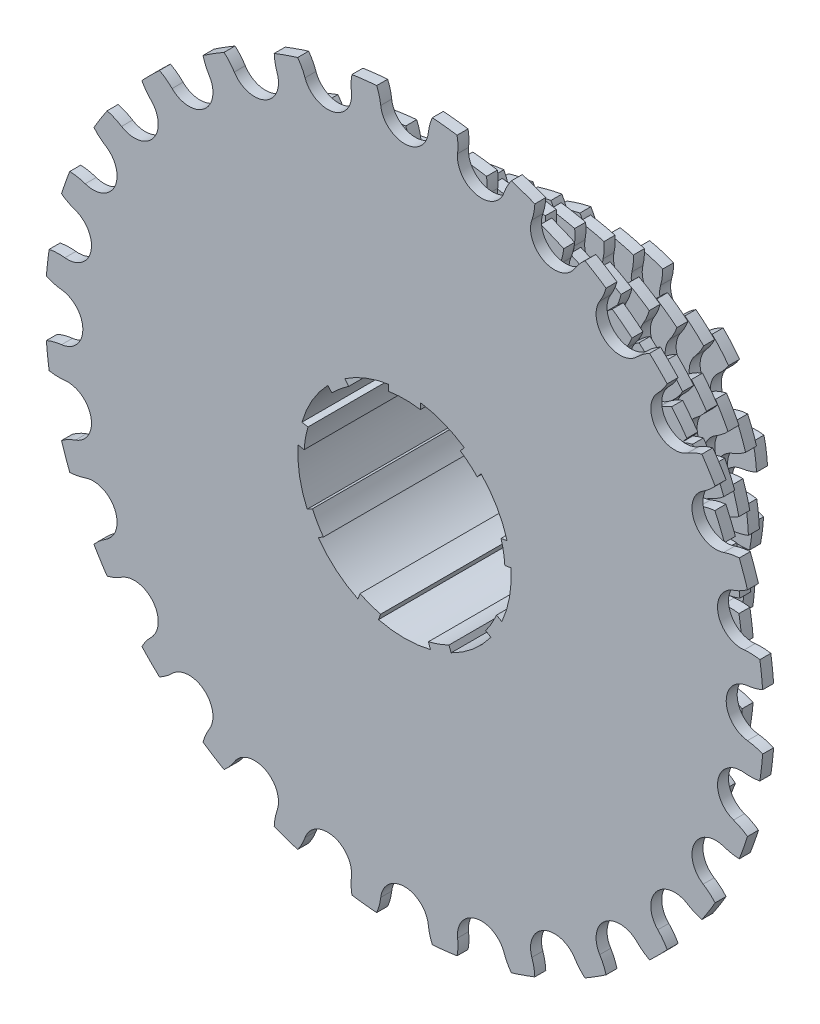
from build123d import *

# Parameters (mm, degrees)
SK_NUCLEO_R    = 18.5
NUCLEO_DEPTH   = 35.4
SK_DISCO_0_R   = 24.21046977
SK_DISCO_0_R_2 = 18.5
DISCO_0_DEPTH  = 1.8
HUECO_0_DEPTH  = 1.8
MATRIZ_0_COUNT = 11
SK_DISCO_1_R   = 28.347453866
SK_DISCO_1_R_2 = 18.5
DISCO_1_DEPTH  = 1.8
HUECO_1_DEPTH  = 1.8
MATRIZ_1_COUNT = 13
SK_DISCO_2_R   = 32.459479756
SK_DISCO_2_R_2 = 18.5
DISCO_2_DEPTH  = 1.8
HUECO_2_DEPTH  = 1.8
MATRIZ_2_COUNT = 15
SK_DISCO_3_R   = 36.555266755
SK_DISCO_3_R_2 = 18.5
DISCO_3_DEPTH  = 1.8
HUECO_3_DEPTH  = 1.8
MATRIZ_3_COUNT = 17
SK_DISCO_4_R   = 40.639902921
SK_DISCO_4_R_2 = 18.5
DISCO_4_DEPTH  = 1.8
HUECO_4_DEPTH  = 1.8
MATRIZ_4_COUNT = 19
SK_DISCO_5_R   = 44.716554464
SK_DISCO_5_R_2 = 18.5
DISCO_5_DEPTH  = 1.8
HUECO_5_DEPTH  = 1.8
MATRIZ_5_COUNT = 21
SK_DISCO_6_R   = 50.820906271
SK_DISCO_6_R_2 = 18.5
DISCO_6_DEPTH  = 1.8
HUECO_6_DEPTH  = 1.8
MATRIZ_6_COUNT = 24
SK_DISCO_7_R   = 58.946559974
SK_DISCO_7_R_2 = 18.5
DISCO_7_DEPTH  = 1.8
HUECO_7_DEPTH  = 1.8
MATRIZ_7_COUNT = 28


with BuildPart() as part:
    # Sk_Nucleo → Nucleo (new body)
    with BuildSketch(Plane.XY):
        Circle(SK_NUCLEO_R)
        with BuildLine():
            Line((2.6, 17.305779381), (2.6, 16.293863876))
            ThreePointArc((2.6, 16.293863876), (0, 16.5), (-2.6, 16.293863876))
            Line((-2.6, 16.293863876), (-2.6, 17.305779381))
            ThreePointArc((-2.6, 17.305779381), (-6.362648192, 16.302352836), (-9.810241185, 14.491693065))
            Line((-9.810241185, 14.491693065), (-9.163816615, 13.721314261))
            ThreePointArc((-9.163816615, 13.721314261), (-10.60599556, 12.639733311), (-11.92157661, 11.407278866))
            Line((-11.92157661, 11.407278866), (-12.56800118, 12.17765767))
            ThreePointArc((-12.56800118, 12.17765767), (-15.155444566, 8.75), (-16.830161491, 4.795379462))
            Line((-16.830161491, 4.795379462), (-15.839781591, 4.620748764))
            ThreePointArc((-15.839781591, 4.620748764), (-16.249327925, 2.865194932), (-16.464915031, 1.075440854))
            Line((-16.464915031, 1.075440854), (-17.455294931, 1.250071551))
            ThreePointArc((-17.455294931, 1.250071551), (-17.234135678, -3.038843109), (-15.975062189, -7.144745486))
            Line((-15.975062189, -7.144745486), (-15.104136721, -6.641916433))
            ThreePointArc((-15.104136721, -6.641916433), (-14.289419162, -8.25), (-13.304136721, -9.759607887))
            Line((-13.304136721, -9.759607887), (-14.175062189, -10.26243694))
            ThreePointArc((-14.175062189, -10.26243694), (-11.24878317, -13.405777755), (-7.645053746, -15.741764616))
            Line((-7.645053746, -15.741764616), (-7.301098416, -14.796755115))
            ThreePointArc((-7.301098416, -14.796755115), (-5.643332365, -15.504928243), (-3.918204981, -16.028027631))
            Line((-3.918204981, -16.028027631), (-4.262160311, -16.973037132))
            ThreePointArc((-4.262160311, -16.973037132), (0, -17.5), (4.262160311, -16.973037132))
            Line((4.262160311, -16.973037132), (3.918204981, -16.028027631))
            ThreePointArc((3.918204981, -16.028027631), (5.643332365, -15.504928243), (7.301098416, -14.796755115))
            Line((7.301098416, -14.796755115), (7.645053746, -15.741764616))
            ThreePointArc((7.645053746, -15.741764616), (11.24878317, -13.405777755), (14.175062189, -10.26243694))
            Line((14.175062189, -10.26243694), (13.304136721, -9.759607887))
            ThreePointArc((13.304136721, -9.759607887), (14.289419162, -8.25), (15.104136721, -6.641916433))
            Line((15.104136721, -6.641916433), (15.975062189, -7.144745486))
            ThreePointArc((15.975062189, -7.144745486), (17.234135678, -3.038843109), (17.455294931, 1.250071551))
            Line((17.455294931, 1.250071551), (16.464915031, 1.075440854))
            ThreePointArc((16.464915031, 1.075440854), (16.249327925, 2.865194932), (15.839781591, 4.620748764))
            Line((15.839781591, 4.620748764), (16.830161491, 4.795379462))
            ThreePointArc((16.830161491, 4.795379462), (15.155444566, 8.75), (12.56800118, 12.17765767))
            Line((12.56800118, 12.17765767), (11.92157661, 11.407278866))
            ThreePointArc((11.92157661, 11.407278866), (10.60599556, 12.639733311), (9.163816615, 13.721314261))
            Line((9.163816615, 13.721314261), (9.810241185, 14.491693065))
            ThreePointArc((9.810241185, 14.491693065), (6.362648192, 16.302352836), (2.6, 17.305779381))
        make_face(mode=Mode.SUBTRACT)
    extrude(amount=NUCLEO_DEPTH)

    # Sk_Disco_0 → Disco_0 (add)
    with BuildSketch(Plane.XY):
        Circle(SK_DISCO_0_R)
        Circle(SK_DISCO_0_R_2, mode=Mode.SUBTRACT)
    extrude(amount=DISCO_0_DEPTH)

    # Sk_Hueco_0 → Hueco_0 (cut)
    with BuildSketch(Plane.XY):
        with BuildLine():
            ThreePointArc((-3.768574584, 21.432552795), (0, 18.611433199), (3.768574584, 21.432552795))
            ThreePointArc((3.768574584, 21.432552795), (4.747923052, 23.612475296), (6.279262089, 25.447192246))
            ThreePointArc((6.279262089, 25.447192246), (0, 26.21046977), (-6.279262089, 25.447192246))
            ThreePointArc((-6.279262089, 25.447192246), (-4.747923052, 23.612475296), (-3.768574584, 21.432552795))
        make_face()
    hueco_0 = extrude(amount=HUECO_0_DEPTH, mode=Mode.SUBTRACT)

    # Matriz_0: Hueco_0 ×11 about axis
    matriz_0_axis = Axis((0, 0, 0), (0, 0, 1))
    for i in range(1, MATRIZ_0_COUNT):
        add(hueco_0.rotate(matriz_0_axis, i * 360 / MATRIZ_0_COUNT), mode=Mode.SUBTRACT)

    # Sk_Disco_1 → Disco_1 (add)
    with BuildSketch(Plane.XY.offset(4.8)):
        Circle(SK_DISCO_1_R)
        Circle(SK_DISCO_1_R_2, mode=Mode.SUBTRACT)
    extrude(amount=DISCO_1_DEPTH)

    # Sk_Hueco_1 → Hueco_1 (cut)
    with BuildSketch(Plane.XY.offset(4.8)):
        with BuildLine():
            ThreePointArc((-3.813541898, 25.59403867), (0, 22.606319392), (3.813541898, 25.59403867))
            ThreePointArc((3.813541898, 25.59403867), (4.697239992, 27.816722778), (6.148479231, 29.718077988))
            ThreePointArc((6.148479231, 29.718077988), (0, 30.347453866), (-6.148479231, 29.718077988))
            ThreePointArc((-6.148479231, 29.718077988), (-4.697239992, 27.816722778), (-3.813541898, 25.59403867))
        make_face()
    hueco_1 = extrude(amount=HUECO_1_DEPTH, mode=Mode.SUBTRACT)

    # Matriz_1: Hueco_1 ×13 about axis
    matriz_1_axis = Axis((0, 0, 0), (0, 0, 1))
    for i in range(1, MATRIZ_1_COUNT):
        add(hueco_1.rotate(matriz_1_axis, i * 360 / MATRIZ_1_COUNT), mode=Mode.SUBTRACT)

    # Sk_Disco_2 → Disco_2 (add)
    with BuildSketch(Plane.XY.offset(9.6)):
        Circle(SK_DISCO_2_R)
        Circle(SK_DISCO_2_R_2, mode=Mode.SUBTRACT)
    extrude(amount=DISCO_2_DEPTH)

    # Sk_Hueco_2 → Hueco_2 (cut)
    with BuildSketch(Plane.XY.offset(9.6)):
        with BuildLine():
            ThreePointArc((-3.841843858, 29.725203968), (0, 26.614140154), (3.841843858, 29.725203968))
            ThreePointArc((3.841843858, 29.725203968), (4.654353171, 31.976872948), (6.045298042, 33.925066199))
            ThreePointArc((6.045298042, 33.925066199), (0, 34.459479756), (-6.045298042, 33.925066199))
            ThreePointArc((-6.045298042, 33.925066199), (-4.654353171, 31.976872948), (-3.841843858, 29.725203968))
        make_face()
    hueco_2 = extrude(amount=HUECO_2_DEPTH, mode=Mode.SUBTRACT)

    # Matriz_2: Hueco_2 ×15 about axis
    matriz_2_axis = Axis((0, 0, 0), (0, 0, 1))
    for i in range(1, MATRIZ_2_COUNT):
        add(hueco_2.rotate(matriz_2_axis, i * 360 / MATRIZ_2_COUNT), mode=Mode.SUBTRACT)

    # Sk_Disco_3 → Disco_3 (add)
    with BuildSketch(Plane.XY.offset(14.4)):
        Circle(SK_DISCO_3_R)
        Circle(SK_DISCO_3_R_2, mode=Mode.SUBTRACT)
    extrude(amount=DISCO_3_DEPTH)

    # Sk_Hueco_3 → Hueco_3 (cut)
    with BuildSketch(Plane.XY.offset(14.4)):
        with BuildLine():
            ThreePointArc((-3.860796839, 33.836205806), (0, 30.630240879), (3.860796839, 33.836205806))
            ThreePointArc((3.860796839, 33.836205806), (4.618295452, 36.108650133), (5.962257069, 38.091469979))
            ThreePointArc((5.962257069, 38.091469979), (0, 38.555266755), (-5.962257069, 38.091469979))
            ThreePointArc((-5.962257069, 38.091469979), (-4.618295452, 36.108650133), (-3.860796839, 33.836205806))
        make_face()
    hueco_3 = extrude(amount=HUECO_3_DEPTH, mode=Mode.SUBTRACT)

    # Matriz_3: Hueco_3 ×17 about axis
    matriz_3_axis = Axis((0, 0, 0), (0, 0, 1))
    for i in range(1, MATRIZ_3_COUNT):
        add(hueco_3.rotate(matriz_3_axis, i * 360 / MATRIZ_3_COUNT), mode=Mode.SUBTRACT)

    # Sk_Disco_4 → Disco_4 (add)
    with BuildSketch(Plane.XY.offset(19.2)):
        Circle(SK_DISCO_4_R)
        Circle(SK_DISCO_4_R_2, mode=Mode.SUBTRACT)
    extrude(amount=DISCO_4_DEPTH)

    # Sk_Hueco_4 → Hueco_4 (cut)
    with BuildSketch(Plane.XY.offset(19.2)):
        with BuildLine():
            ThreePointArc((-3.874104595, 37.933166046), (0, 34.651966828), (3.874104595, 37.933166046))
            ThreePointArc((3.874104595, 37.933166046), (4.587836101, 40.221145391), (5.894176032, 42.230557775))
            ThreePointArc((5.894176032, 42.230557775), (0, 42.639902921), (-5.894176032, 42.230557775))
            ThreePointArc((-5.894176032, 42.230557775), (-4.587836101, 40.221145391), (-3.874104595, 37.933166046))
        make_face()
    hueco_4 = extrude(amount=HUECO_4_DEPTH, mode=Mode.SUBTRACT)

    # Matriz_4: Hueco_4 ×19 about axis
    matriz_4_axis = Axis((0, 0, 0), (0, 0, 1))
    for i in range(1, MATRIZ_4_COUNT):
        add(hueco_4.rotate(matriz_4_axis, i * 360 / MATRIZ_4_COUNT), mode=Mode.SUBTRACT)

    # Sk_Disco_5 → Disco_5 (add)
    with BuildSketch(Plane.XY.offset(24)):
        Circle(SK_DISCO_5_R)
        Circle(SK_DISCO_5_R_2, mode=Mode.SUBTRACT)
    extrude(amount=DISCO_5_DEPTH)

    # Sk_Hueco_5 → Hueco_5 (cut)
    with BuildSketch(Plane.XY.offset(24)):
        with BuildLine():
            ThreePointArc((-3.883804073, 42.019974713), (0, 38.677691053), (3.883804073, 42.019974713))
            ThreePointArc((3.883804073, 42.019974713), (4.561893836, 44.319961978), (5.837439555, 46.350412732))
            ThreePointArc((5.837439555, 46.350412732), (0, 46.716554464), (-5.837439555, 46.350412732))
            ThreePointArc((-5.837439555, 46.350412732), (-4.561893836, 44.319961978), (-3.883804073, 42.019974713))
        make_face()
    hueco_5 = extrude(amount=HUECO_5_DEPTH, mode=Mode.SUBTRACT)

    # Matriz_5: Hueco_5 ×21 about axis
    matriz_5_axis = Axis((0, 0, 0), (0, 0, 1))
    for i in range(1, MATRIZ_5_COUNT):
        add(hueco_5.rotate(matriz_5_axis, i * 360 / MATRIZ_5_COUNT), mode=Mode.SUBTRACT)

    # Sk_Disco_6 → Disco_6 (add)
    with BuildSketch(Plane.XY.offset(28.8)):
        Circle(SK_DISCO_6_R)
        Circle(SK_DISCO_6_R_2, mode=Mode.SUBTRACT)
    extrude(amount=DISCO_6_DEPTH)

    # Sk_Hueco_6 → Hueco_6 (cut)
    with BuildSketch(Plane.XY.offset(28.8)):
        with BuildLine():
            ThreePointArc((-3.894071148, 48.136575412), (0, 44.72156667), (3.894071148, 48.136575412))
            ThreePointArc((3.894071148, 48.136575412), (4.529598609, 50.450153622), (5.768187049, 52.505010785))
            ThreePointArc((5.768187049, 52.505010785), (0, 52.820906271), (-5.768187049, 52.505010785))
            ThreePointArc((-5.768187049, 52.505010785), (-4.529598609, 50.450153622), (-3.894071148, 48.136575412))
        make_face()
    hueco_6 = extrude(amount=HUECO_6_DEPTH, mode=Mode.SUBTRACT)

    # Matriz_6: Hueco_6 ×24 about axis
    matriz_6_axis = Axis((0, 0, 0), (0, 0, 1))
    for i in range(1, MATRIZ_6_COUNT):
        add(hueco_6.rotate(matriz_6_axis, i * 360 / MATRIZ_6_COUNT), mode=Mode.SUBTRACT)

    # Sk_Disco_7 → Disco_7 (add)
    with BuildSketch(Plane.XY.offset(33.6)):
        Circle(SK_DISCO_7_R)
        Circle(SK_DISCO_7_R_2, mode=Mode.SUBTRACT)
    extrude(amount=DISCO_7_DEPTH)

    # Sk_Hueco_7 → Hueco_7 (cut)
    with BuildSketch(Plane.XY.offset(33.6)):
        with BuildLine():
            ThreePointArc((-3.902976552, 56.274657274), (0, 52.786744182), (3.902976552, 56.274657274))
            ThreePointArc((3.902976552, 56.274657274), (4.495692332, 58.601091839), (5.696905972, 60.67972013))
            ThreePointArc((5.696905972, 60.67972013), (0, 60.946559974), (-5.696905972, 60.67972013))
            ThreePointArc((-5.696905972, 60.67972013), (-4.495692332, 58.601091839), (-3.902976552, 56.274657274))
        make_face()
    hueco_7 = extrude(amount=HUECO_7_DEPTH, mode=Mode.SUBTRACT)

    # Matriz_7: Hueco_7 ×28 about axis
    matriz_7_axis = Axis((0, 0, 0), (0, 0, 1))
    for i in range(1, MATRIZ_7_COUNT):
        add(hueco_7.rotate(matriz_7_axis, i * 360 / MATRIZ_7_COUNT), mode=Mode.SUBTRACT)


solid = part.part
